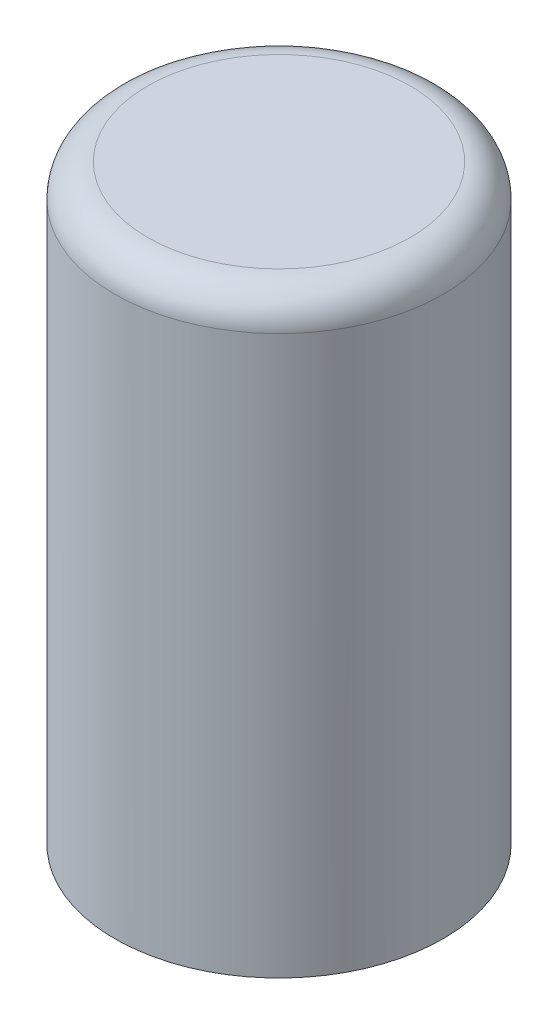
from build123d import *

# Parameters (mm, degrees)
FILLET1_R = 0.635


with BuildPart() as part:
    # Sketch1 → Revolve1 (revolve)
    with BuildSketch(Plane(origin=(0, 0, 0), x_dir=(0, 0, -1), z_dir=(1, 0, 0))):
        Polygon((0, 13.230223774), (0, 4.144668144), (2.794, 1.800223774), (3.175, 1.800223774), (3.175, 13.230223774), align=None)
    revolve(axis=Axis((0, 0, 0), (0, 1, 0)))

    # Fillet1
    fillet1_edges = [part.edges().sort_by_distance(p)[0] for p in [
        (0, 13.230223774, 3.175),
    ]]
    fillet(fillet1_edges, radius=FILLET1_R)


solid = part.part
